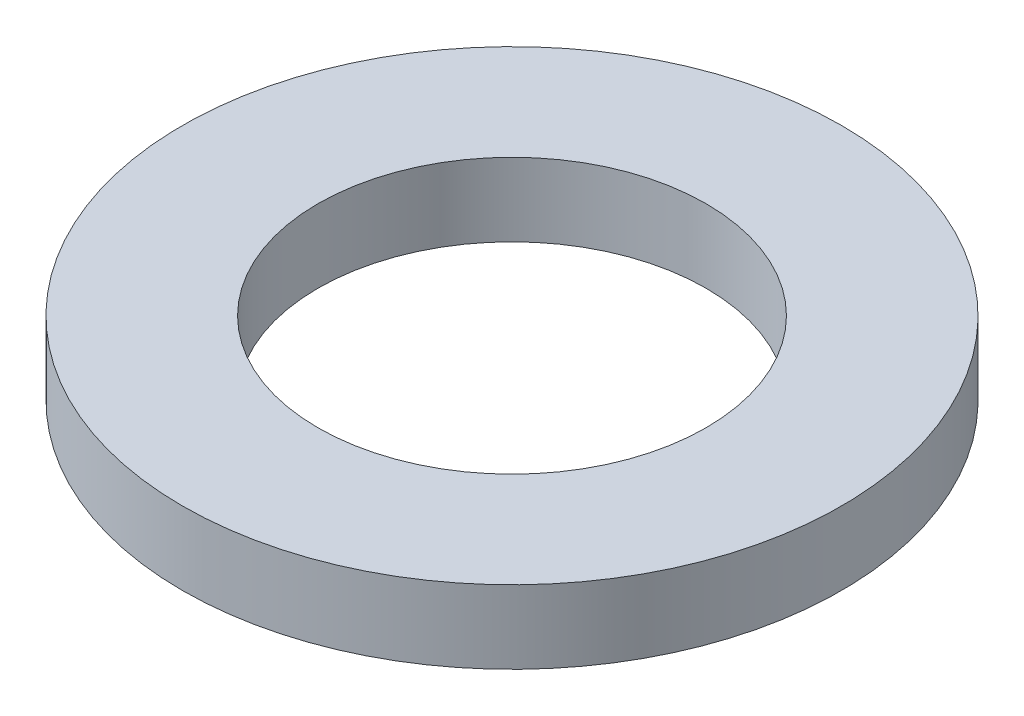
from build123d import *

# Parameters (mm, degrees)
SKIZZE1_R                       = 4.5
SKIZZE1_R_2                     = 2.65
AUFSATZ_LINEAR_AUSTRAGEN1_DEPTH = 1


with BuildPart() as part:
    # Skizze1 → Aufsatz-Linear austragen1 (new body)
    with BuildSketch(Plane(origin=(0, 0, 0), x_dir=(1, 0, 0), z_dir=(0, 1, 0))):
        with Locations(Location((0, 0, 0), (0, 0, 270))):
            Circle(SKIZZE1_R)
        with Locations(Location((0, 0, 0), (0, 0, 270))):
            Circle(SKIZZE1_R_2, mode=Mode.SUBTRACT)
    extrude(amount=AUFSATZ_LINEAR_AUSTRAGEN1_DEPTH)


solid = part.part
